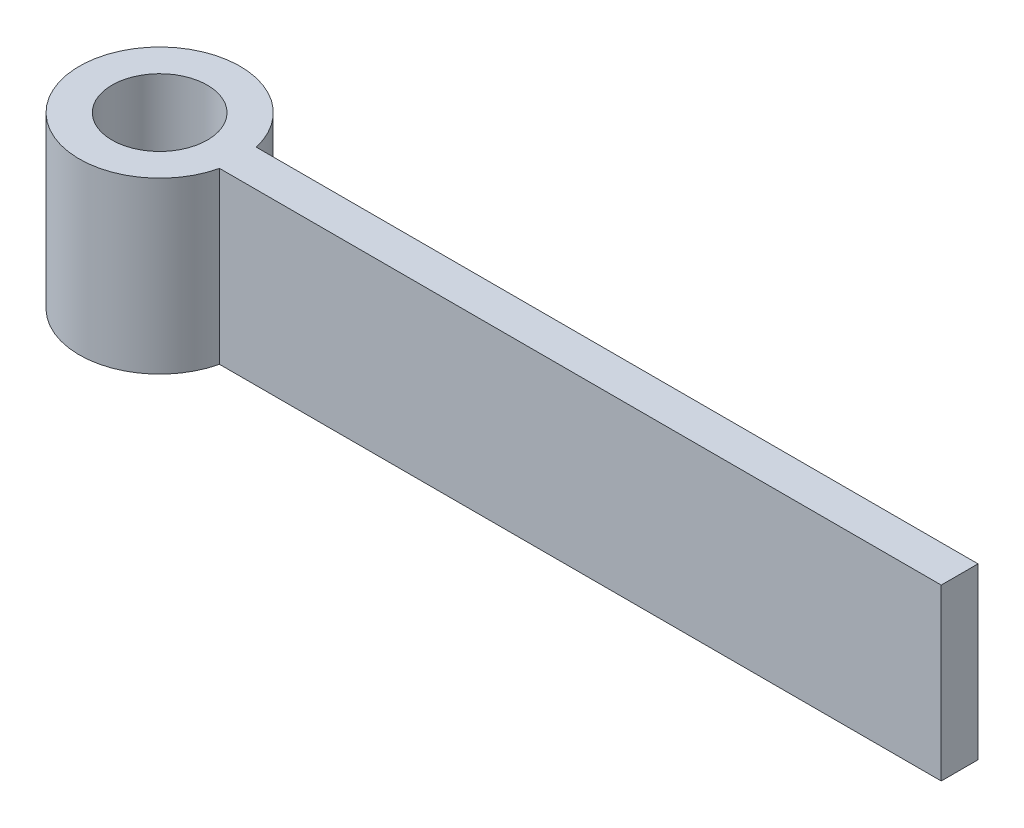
from build123d import *

# Parameters (mm, degrees)
SKETCH1_R      = 52.211638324
SKETCH1_R_2    = 30.955689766
EXTRUDE1_DEPTH = 110.236
SKETCH2_W      = 488.647198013
SKETCH2_H      = 110.236
EXTRUDE2_DEPTH = 11.938


with BuildPart() as part:
    # Sketch1 → Extrude1 (new body)
    with BuildSketch(Plane(origin=(0, 0, 0), x_dir=(1, 0, 0), z_dir=(0, 1, 0))):
        with Locations(Location((0, 0, 0), (0, 0, 270))):
            Circle(SKETCH1_R)
        with Locations(Location((0, 0, 0), (0, 0, 270))):
            Circle(SKETCH1_R_2, mode=Mode.SUBTRACT)
    extrude(amount=EXTRUDE1_DEPTH)

    # Sketch2 → Extrude2 (add, symmetric)
    with BuildSketch(Plane.XY):
        with Locations((275.279288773, 55.118)):
            Rectangle(SKETCH2_W, SKETCH2_H)
    extrude(amount=EXTRUDE2_DEPTH, both=True)


solid = part.part
